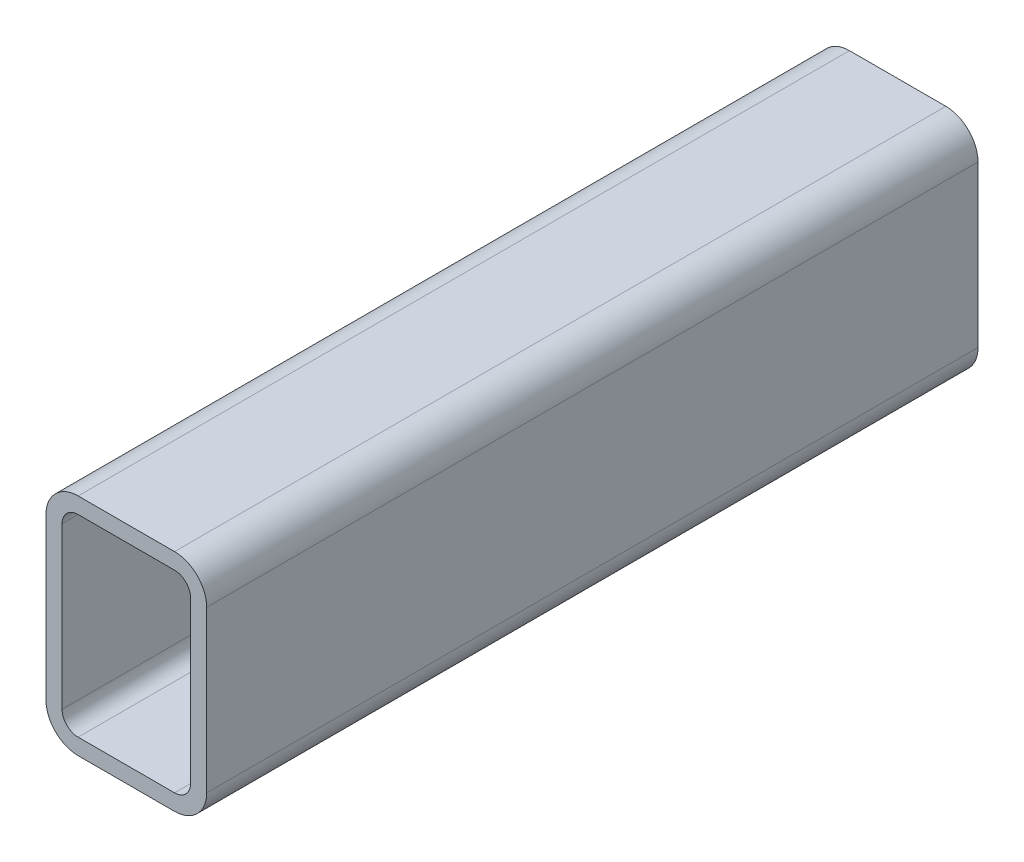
ISO-10303-21;
HEADER;
FILE_DESCRIPTION(('STEP AP214'),'2;1');
FILE_NAME('part.step','',(''),(''),'','','');
FILE_SCHEMA(('AUTOMOTIVE_DESIGN { 1 0 10303 214 1 1 1 1 }'));
ENDSEC;
DATA;
#1=APPLICATION_CONTEXT('core data for automotive mechanical design processes');
#2=APPLICATION_PROTOCOL_DEFINITION('international standard','automotive_design',2000,#1);
#3=PRODUCT_CONTEXT('',#1,'mechanical');
#4=PRODUCT('Part','Part','',(#3));
#5=PRODUCT_RELATED_PRODUCT_CATEGORY('part','',(#4));
#6=PRODUCT_DEFINITION_FORMATION('','',#4);
#7=PRODUCT_DEFINITION_CONTEXT('part definition',#1,'design');
#8=PRODUCT_DEFINITION('design','',#6,#7);
#9=PRODUCT_DEFINITION_SHAPE('','',#8);
#10=(LENGTH_UNIT() NAMED_UNIT(*) SI_UNIT(.MILLI.,.METRE.));
#11=(NAMED_UNIT(*) PLANE_ANGLE_UNIT() SI_UNIT($,.RADIAN.));
#12=(NAMED_UNIT(*) SI_UNIT($,.STERADIAN.) SOLID_ANGLE_UNIT());
#13=UNCERTAINTY_MEASURE_WITH_UNIT(LENGTH_MEASURE(1.E-05),#10,'distance_accuracy_value','');
#14=(GEOMETRIC_REPRESENTATION_CONTEXT(3) GLOBAL_UNCERTAINTY_ASSIGNED_CONTEXT((#13)) GLOBAL_UNIT_ASSIGNED_CONTEXT((#10,
#11,#12)) REPRESENTATION_CONTEXT('',''));
#15=CARTESIAN_POINT('',(0.,0.,0.));
#16=DIRECTION('',(0.,0.,1.));
#17=DIRECTION('',(1.,0.,0.));
#18=AXIS2_PLACEMENT_3D('',#15,#16,#17);
#19=CARTESIAN_POINT('',(15.5960851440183,77.0015103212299,304.8));
#20=DIRECTION('',(0.,0.,1.));
#21=DIRECTION('',(1.,0.,0.));
#22=AXIS2_PLACEMENT_3D('',#19,#20,#21);
#23=PLANE('',#22);
#24=CARTESIAN_POINT('',(15.5960851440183,77.0015103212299,304.8));
#25=DIRECTION('',(0.,0.,1.));
#26=DIRECTION('',(1.,0.,0.));
#27=AXIS2_PLACEMENT_3D('',#24,#25,#26);
#28=CIRCLE('',#27,12.7);
#29=CARTESIAN_POINT('',(15.5960851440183,89.7015103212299,304.8));
#30=VERTEX_POINT('',#29);
#31=CARTESIAN_POINT('',(2.89608514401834,77.0015103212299,304.8));
#32=VERTEX_POINT('',#31);
#33=EDGE_CURVE('E211',#30,#32,#28,.T.);
#34=ORIENTED_EDGE('',*,*,#33,.T.);
#35=DIRECTION('',(0.,-1.,0.));
#36=VECTOR('',#35,1.);
#37=CARTESIAN_POINT('',(2.89608514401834,13.5015103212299,304.8));
#38=LINE('',#37,#36);
#39=CARTESIAN_POINT('',(2.89608514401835,13.5015103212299,304.8));
#40=VERTEX_POINT('',#39);
#41=EDGE_CURVE('E214',#32,#40,#38,.T.);
#42=ORIENTED_EDGE('',*,*,#41,.T.);
#43=CARTESIAN_POINT('',(15.5960851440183,13.5015103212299,304.8));
#44=DIRECTION('',(0.,0.,1.));
#45=DIRECTION('',(1.,0.,0.));
#46=AXIS2_PLACEMENT_3D('',#43,#44,#45);
#47=CIRCLE('',#46,12.7);
#48=CARTESIAN_POINT('',(15.5960851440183,0.801510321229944,304.8));
#49=VERTEX_POINT('',#48);
#50=EDGE_CURVE('E217',#40,#49,#47,.T.);
#51=ORIENTED_EDGE('',*,*,#50,.T.);
#52=DIRECTION('',(1.,0.,0.));
#53=VECTOR('',#52,1.);
#54=CARTESIAN_POINT('',(53.6960851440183,0.801510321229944,304.8));
#55=LINE('',#54,#53);
#56=CARTESIAN_POINT('',(53.6960851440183,0.801510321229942,304.8));
#57=VERTEX_POINT('',#56);
#58=EDGE_CURVE('E219',#49,#57,#55,.T.);
#59=ORIENTED_EDGE('',*,*,#58,.T.);
#60=CARTESIAN_POINT('',(53.6960851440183,13.5015103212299,304.8));
#61=DIRECTION('',(0.,0.,1.));
#62=DIRECTION('',(1.,0.,0.));
#63=AXIS2_PLACEMENT_3D('',#60,#61,#62);
#64=CIRCLE('',#63,12.7);
#65=CARTESIAN_POINT('',(66.3960851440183,13.5015103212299,304.8));
#66=VERTEX_POINT('',#65);
#67=EDGE_CURVE('E221',#57,#66,#64,.T.);
#68=ORIENTED_EDGE('',*,*,#67,.T.);
#69=DIRECTION('',(0.,1.,0.));
#70=VECTOR('',#69,1.);
#71=CARTESIAN_POINT('',(66.3960851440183,77.0015103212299,304.8));
#72=LINE('',#71,#70);
#73=CARTESIAN_POINT('',(66.3960851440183,77.0015103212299,304.8));
#74=VERTEX_POINT('',#73);
#75=EDGE_CURVE('E223',#66,#74,#72,.T.);
#76=ORIENTED_EDGE('',*,*,#75,.T.);
#77=CARTESIAN_POINT('',(53.6960851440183,77.0015103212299,304.8));
#78=DIRECTION('',(0.,0.,1.));
#79=DIRECTION('',(1.,0.,0.));
#80=AXIS2_PLACEMENT_3D('',#77,#78,#79);
#81=CIRCLE('',#80,12.7);
#82=CARTESIAN_POINT('',(53.6960851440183,89.7015103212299,304.8));
#83=VERTEX_POINT('',#82);
#84=EDGE_CURVE('E225',#74,#83,#81,.T.);
#85=ORIENTED_EDGE('',*,*,#84,.T.);
#86=DIRECTION('',(-1.,0.,0.));
#87=VECTOR('',#86,1.);
#88=CARTESIAN_POINT('',(15.5960851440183,89.7015103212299,304.8));
#89=LINE('',#88,#87);
#90=EDGE_CURVE('E227',#83,#30,#89,.T.);
#91=ORIENTED_EDGE('',*,*,#90,.T.);
#92=EDGE_LOOP('',(#34,#42,#51,#59,#68,#76,#85,#91));
#93=FACE_BOUND('',#92,.T.);
#94=DIRECTION('',(0.,-1.,0.));
#95=VECTOR('',#94,1.);
#96=CARTESIAN_POINT('',(9.24608514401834,13.5015103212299,304.8));
#97=LINE('',#96,#95);
#98=CARTESIAN_POINT('',(9.24608514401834,77.0015103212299,304.8));
#99=VERTEX_POINT('',#98);
#100=CARTESIAN_POINT('',(9.24608514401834,13.5015103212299,304.8));
#101=VERTEX_POINT('',#100);
#102=EDGE_CURVE('E154',#99,#101,#97,.T.);
#103=ORIENTED_EDGE('',*,*,#102,.F.);
#104=CARTESIAN_POINT('',(15.5960851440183,77.0015103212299,304.8));
#105=DIRECTION('',(0.,0.,1.));
#106=DIRECTION('',(1.,0.,0.));
#107=AXIS2_PLACEMENT_3D('',#104,#105,#106);
#108=CIRCLE('',#107,6.35000000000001);
#109=CARTESIAN_POINT('',(15.5960851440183,83.3515103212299,304.8));
#110=VERTEX_POINT('',#109);
#111=EDGE_CURVE('E146',#110,#99,#108,.T.);
#112=ORIENTED_EDGE('',*,*,#111,.F.);
#113=DIRECTION('',(-1.,0.,0.));
#114=VECTOR('',#113,1.);
#115=CARTESIAN_POINT('',(15.5960851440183,83.3515103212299,304.8));
#116=LINE('',#115,#114);
#117=CARTESIAN_POINT('',(53.6960851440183,83.3515103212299,304.8));
#118=VERTEX_POINT('',#117);
#119=EDGE_CURVE('E179',#118,#110,#116,.T.);
#120=ORIENTED_EDGE('',*,*,#119,.F.);
#121=CARTESIAN_POINT('',(53.6960851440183,77.0015103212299,304.8));
#122=DIRECTION('',(0.,0.,1.));
#123=DIRECTION('',(1.,0.,0.));
#124=AXIS2_PLACEMENT_3D('',#121,#122,#123);
#125=CIRCLE('',#124,6.35000000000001);
#126=CARTESIAN_POINT('',(60.0460851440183,77.0015103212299,304.8));
#127=VERTEX_POINT('',#126);
#128=EDGE_CURVE('E177',#127,#118,#125,.T.);
#129=ORIENTED_EDGE('',*,*,#128,.F.);
#130=DIRECTION('',(0.,1.,0.));
#131=VECTOR('',#130,1.);
#132=CARTESIAN_POINT('',(60.0460851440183,77.0015103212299,304.8));
#133=LINE('',#132,#131);
#134=CARTESIAN_POINT('',(60.0460851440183,13.5015103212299,304.8));
#135=VERTEX_POINT('',#134);
#136=EDGE_CURVE('E175',#135,#127,#133,.T.);
#137=ORIENTED_EDGE('',*,*,#136,.F.);
#138=CARTESIAN_POINT('',(53.6960851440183,13.5015103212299,304.8));
#139=DIRECTION('',(0.,0.,1.));
#140=DIRECTION('',(1.,0.,0.));
#141=AXIS2_PLACEMENT_3D('',#138,#139,#140);
#142=CIRCLE('',#141,6.35000000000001);
#143=CARTESIAN_POINT('',(53.6960851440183,7.15151032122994,304.8));
#144=VERTEX_POINT('',#143);
#145=EDGE_CURVE('E173',#144,#135,#142,.T.);
#146=ORIENTED_EDGE('',*,*,#145,.F.);
#147=DIRECTION('',(1.,0.,0.));
#148=VECTOR('',#147,1.);
#149=CARTESIAN_POINT('',(53.6960851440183,7.15151032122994,304.8));
#150=LINE('',#149,#148);
#151=CARTESIAN_POINT('',(15.5960851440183,7.15151032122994,304.8));
#152=VERTEX_POINT('',#151);
#153=EDGE_CURVE('E169',#152,#144,#150,.T.);
#154=ORIENTED_EDGE('',*,*,#153,.F.);
#155=CARTESIAN_POINT('',(15.5960851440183,13.5015103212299,304.8));
#156=DIRECTION('',(0.,0.,1.));
#157=DIRECTION('',(1.,0.,0.));
#158=AXIS2_PLACEMENT_3D('',#155,#156,#157);
#159=CIRCLE('',#158,6.35);
#160=EDGE_CURVE('E167',#101,#152,#159,.T.);
#161=ORIENTED_EDGE('',*,*,#160,.F.);
#162=EDGE_LOOP('',(#103,#112,#120,#129,#137,#146,#154,#161));
#163=FACE_BOUND('',#162,.T.);
#164=ADVANCED_FACE('F33',(#93,#163),#23,.T.);
#165=CARTESIAN_POINT('',(15.5960851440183,77.0015103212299,0.));
#166=DIRECTION('',(0.,0.,1.));
#167=DIRECTION('',(1.,0.,0.));
#168=AXIS2_PLACEMENT_3D('',#165,#166,#167);
#169=PLANE('',#168);
#170=CARTESIAN_POINT('',(15.5960851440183,77.0015103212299,0.));
#171=DIRECTION('',(0.,0.,1.));
#172=DIRECTION('',(1.,0.,0.));
#173=AXIS2_PLACEMENT_3D('',#170,#171,#172);
#174=CIRCLE('',#173,12.7);
#175=CARTESIAN_POINT('',(15.5960851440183,89.7015103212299,0.));
#176=VERTEX_POINT('',#175);
#177=CARTESIAN_POINT('',(2.89608514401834,77.0015103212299,0.));
#178=VERTEX_POINT('',#177);
#179=EDGE_CURVE('E162',#176,#178,#174,.T.);
#180=ORIENTED_EDGE('',*,*,#179,.F.);
#181=DIRECTION('',(-1.,0.,0.));
#182=VECTOR('',#181,1.);
#183=CARTESIAN_POINT('',(15.5960851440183,89.7015103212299,0.));
#184=LINE('',#183,#182);
#185=CARTESIAN_POINT('',(53.6960851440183,89.7015103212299,0.));
#186=VERTEX_POINT('',#185);
#187=EDGE_CURVE('E215',#186,#176,#184,.T.);
#188=ORIENTED_EDGE('',*,*,#187,.F.);
#189=CARTESIAN_POINT('',(53.6960851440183,77.0015103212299,0.));
#190=DIRECTION('',(0.,0.,1.));
#191=DIRECTION('',(1.,0.,0.));
#192=AXIS2_PLACEMENT_3D('',#189,#190,#191);
#193=CIRCLE('',#192,12.7);
#194=CARTESIAN_POINT('',(66.3960851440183,77.0015103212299,0.));
#195=VERTEX_POINT('',#194);
#196=EDGE_CURVE('E242',#195,#186,#193,.T.);
#197=ORIENTED_EDGE('',*,*,#196,.F.);
#198=DIRECTION('',(0.,1.,0.));
#199=VECTOR('',#198,1.);
#200=CARTESIAN_POINT('',(66.3960851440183,77.0015103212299,0.));
#201=LINE('',#200,#199);
#202=CARTESIAN_POINT('',(66.3960851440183,13.5015103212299,0.));
#203=VERTEX_POINT('',#202);
#204=EDGE_CURVE('E240',#203,#195,#201,.T.);
#205=ORIENTED_EDGE('',*,*,#204,.F.);
#206=CARTESIAN_POINT('',(53.6960851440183,13.5015103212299,0.));
#207=DIRECTION('',(0.,0.,1.));
#208=DIRECTION('',(1.,0.,0.));
#209=AXIS2_PLACEMENT_3D('',#206,#207,#208);
#210=CIRCLE('',#209,12.7);
#211=CARTESIAN_POINT('',(53.6960851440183,0.801510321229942,0.));
#212=VERTEX_POINT('',#211);
#213=EDGE_CURVE('E238',#212,#203,#210,.T.);
#214=ORIENTED_EDGE('',*,*,#213,.F.);
#215=DIRECTION('',(1.,0.,0.));
#216=VECTOR('',#215,1.);
#217=CARTESIAN_POINT('',(53.6960851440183,0.801510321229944,0.));
#218=LINE('',#217,#216);
#219=CARTESIAN_POINT('',(15.5960851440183,0.801510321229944,0.));
#220=VERTEX_POINT('',#219);
#221=EDGE_CURVE('E236',#220,#212,#218,.T.);
#222=ORIENTED_EDGE('',*,*,#221,.F.);
#223=CARTESIAN_POINT('',(15.5960851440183,13.5015103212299,0.));
#224=DIRECTION('',(0.,0.,1.));
#225=DIRECTION('',(1.,0.,0.));
#226=AXIS2_PLACEMENT_3D('',#223,#224,#225);
#227=CIRCLE('',#226,12.7);
#228=CARTESIAN_POINT('',(2.89608514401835,13.5015103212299,0.));
#229=VERTEX_POINT('',#228);
#230=EDGE_CURVE('E234',#229,#220,#227,.T.);
#231=ORIENTED_EDGE('',*,*,#230,.F.);
#232=DIRECTION('',(0.,-1.,0.));
#233=VECTOR('',#232,1.);
#234=CARTESIAN_POINT('',(2.89608514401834,13.5015103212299,0.));
#235=LINE('',#234,#233);
#236=EDGE_CURVE('E232',#178,#229,#235,.T.);
#237=ORIENTED_EDGE('',*,*,#236,.F.);
#238=EDGE_LOOP('',(#180,#188,#197,#205,#214,#222,#231,#237));
#239=FACE_BOUND('',#238,.T.);
#240=CARTESIAN_POINT('',(15.5960851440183,77.0015103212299,0.));
#241=DIRECTION('',(0.,0.,1.));
#242=DIRECTION('',(1.,0.,0.));
#243=AXIS2_PLACEMENT_3D('',#240,#241,#242);
#244=CIRCLE('',#243,6.35000000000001);
#245=CARTESIAN_POINT('',(15.5960851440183,83.3515103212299,0.));
#246=VERTEX_POINT('',#245);
#247=CARTESIAN_POINT('',(9.24608514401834,77.0015103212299,0.));
#248=VERTEX_POINT('',#247);
#249=EDGE_CURVE('E56',#246,#248,#244,.T.);
#250=ORIENTED_EDGE('',*,*,#249,.T.);
#251=DIRECTION('',(0.,-1.,0.));
#252=VECTOR('',#251,1.);
#253=CARTESIAN_POINT('',(9.24608514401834,13.5015103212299,0.));
#254=LINE('',#253,#252);
#255=CARTESIAN_POINT('',(9.24608514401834,13.5015103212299,0.));
#256=VERTEX_POINT('',#255);
#257=EDGE_CURVE('E161',#248,#256,#254,.T.);
#258=ORIENTED_EDGE('',*,*,#257,.T.);
#259=CARTESIAN_POINT('',(15.5960851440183,13.5015103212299,0.));
#260=DIRECTION('',(0.,0.,1.));
#261=DIRECTION('',(1.,0.,0.));
#262=AXIS2_PLACEMENT_3D('',#259,#260,#261);
#263=CIRCLE('',#262,6.35);
#264=CARTESIAN_POINT('',(15.5960851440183,7.15151032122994,0.));
#265=VERTEX_POINT('',#264);
#266=EDGE_CURVE('E183',#256,#265,#263,.T.);
#267=ORIENTED_EDGE('',*,*,#266,.T.);
#268=DIRECTION('',(1.,0.,0.));
#269=VECTOR('',#268,1.);
#270=CARTESIAN_POINT('',(53.6960851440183,7.15151032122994,0.));
#271=LINE('',#270,#269);
#272=CARTESIAN_POINT('',(53.6960851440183,7.15151032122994,0.));
#273=VERTEX_POINT('',#272);
#274=EDGE_CURVE('E186',#265,#273,#271,.T.);
#275=ORIENTED_EDGE('',*,*,#274,.T.);
#276=CARTESIAN_POINT('',(53.6960851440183,13.5015103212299,0.));
#277=DIRECTION('',(0.,0.,1.));
#278=DIRECTION('',(1.,0.,0.));
#279=AXIS2_PLACEMENT_3D('',#276,#277,#278);
#280=CIRCLE('',#279,6.35000000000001);
#281=CARTESIAN_POINT('',(60.0460851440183,13.5015103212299,0.));
#282=VERTEX_POINT('',#281);
#283=EDGE_CURVE('E189',#273,#282,#280,.T.);
#284=ORIENTED_EDGE('',*,*,#283,.T.);
#285=DIRECTION('',(0.,1.,0.));
#286=VECTOR('',#285,1.);
#287=CARTESIAN_POINT('',(60.0460851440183,77.0015103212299,0.));
#288=LINE('',#287,#286);
#289=CARTESIAN_POINT('',(60.0460851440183,77.0015103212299,0.));
#290=VERTEX_POINT('',#289);
#291=EDGE_CURVE('E192',#282,#290,#288,.T.);
#292=ORIENTED_EDGE('',*,*,#291,.T.);
#293=CARTESIAN_POINT('',(53.6960851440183,77.0015103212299,0.));
#294=DIRECTION('',(0.,0.,1.));
#295=DIRECTION('',(1.,0.,0.));
#296=AXIS2_PLACEMENT_3D('',#293,#294,#295);
#297=CIRCLE('',#296,6.35000000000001);
#298=CARTESIAN_POINT('',(53.6960851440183,83.3515103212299,0.));
#299=VERTEX_POINT('',#298);
#300=EDGE_CURVE('E195',#290,#299,#297,.T.);
#301=ORIENTED_EDGE('',*,*,#300,.T.);
#302=DIRECTION('',(-1.,0.,0.));
#303=VECTOR('',#302,1.);
#304=CARTESIAN_POINT('',(15.5960851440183,83.3515103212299,0.));
#305=LINE('',#304,#303);
#306=EDGE_CURVE('E155',#299,#246,#305,.T.);
#307=ORIENTED_EDGE('',*,*,#306,.T.);
#308=EDGE_LOOP('',(#250,#258,#267,#275,#284,#292,#301,#307));
#309=FACE_BOUND('',#308,.T.);
#310=ADVANCED_FACE('F272',(#239,#309),#169,.F.);
#311=CARTESIAN_POINT('',(15.5960851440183,77.0015103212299,304.8));
#312=DIRECTION('',(0.,0.,-1.));
#313=DIRECTION('',(-1.,0.,0.));
#314=AXIS2_PLACEMENT_3D('',#311,#312,#313);
#315=CYLINDRICAL_SURFACE('',#314,12.7);
#316=ORIENTED_EDGE('',*,*,#179,.T.);
#317=DIRECTION('',(0.,0.,-1.));
#318=VECTOR('',#317,1.);
#319=CARTESIAN_POINT('',(2.89608514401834,77.0015103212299,304.8));
#320=LINE('',#319,#318);
#321=EDGE_CURVE('E11',#32,#178,#320,.T.);
#322=ORIENTED_EDGE('',*,*,#321,.F.);
#323=ORIENTED_EDGE('',*,*,#33,.F.);
#324=DIRECTION('',(0.,0.,-1.));
#325=VECTOR('',#324,1.);
#326=CARTESIAN_POINT('',(15.5960851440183,89.7015103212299,304.8));
#327=LINE('',#326,#325);
#328=EDGE_CURVE('E229',#30,#176,#327,.T.);
#329=ORIENTED_EDGE('',*,*,#328,.T.);
#330=EDGE_LOOP('',(#316,#322,#323,#329));
#331=FACE_BOUND('',#330,.T.);
#332=ADVANCED_FACE('F35',(#331),#315,.T.);
#333=CARTESIAN_POINT('',(2.89608514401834,13.5015103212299,304.8));
#334=DIRECTION('',(1.,0.,0.));
#335=DIRECTION('',(0.,0.,-1.));
#336=AXIS2_PLACEMENT_3D('',#333,#334,#335);
#337=PLANE('',#336);
#338=ORIENTED_EDGE('',*,*,#236,.T.);
#339=DIRECTION('',(0.,0.,-1.));
#340=VECTOR('',#339,1.);
#341=CARTESIAN_POINT('',(2.89608514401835,13.5015103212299,304.8));
#342=LINE('',#341,#340);
#343=EDGE_CURVE('E41',#40,#229,#342,.T.);
#344=ORIENTED_EDGE('',*,*,#343,.F.);
#345=ORIENTED_EDGE('',*,*,#41,.F.);
#346=ORIENTED_EDGE('',*,*,#321,.T.);
#347=EDGE_LOOP('',(#338,#344,#345,#346));
#348=FACE_BOUND('',#347,.T.);
#349=ADVANCED_FACE('F289',(#348),#337,.F.);
#350=CARTESIAN_POINT('',(15.5960851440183,13.5015103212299,304.8));
#351=DIRECTION('',(0.,0.,-1.));
#352=DIRECTION('',(-1.,0.,0.));
#353=AXIS2_PLACEMENT_3D('',#350,#351,#352);
#354=CYLINDRICAL_SURFACE('',#353,12.7);
#355=ORIENTED_EDGE('',*,*,#230,.T.);
#356=DIRECTION('',(0.,0.,-1.));
#357=VECTOR('',#356,1.);
#358=CARTESIAN_POINT('',(15.5960851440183,0.801510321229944,304.8));
#359=LINE('',#358,#357);
#360=EDGE_CURVE('E259',#49,#220,#359,.T.);
#361=ORIENTED_EDGE('',*,*,#360,.F.);
#362=ORIENTED_EDGE('',*,*,#50,.F.);
#363=ORIENTED_EDGE('',*,*,#343,.T.);
#364=EDGE_LOOP('',(#355,#361,#362,#363));
#365=FACE_BOUND('',#364,.T.);
#366=ADVANCED_FACE('F266',(#365),#354,.T.);
#367=CARTESIAN_POINT('',(53.6960851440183,0.801510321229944,304.8));
#368=DIRECTION('',(0.,1.,0.));
#369=DIRECTION('',(0.,0.,1.));
#370=AXIS2_PLACEMENT_3D('',#367,#368,#369);
#371=PLANE('',#370);
#372=ORIENTED_EDGE('',*,*,#221,.T.);
#373=DIRECTION('',(0.,0.,-1.));
#374=VECTOR('',#373,1.);
#375=CARTESIAN_POINT('',(53.6960851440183,0.801510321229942,304.8));
#376=LINE('',#375,#374);
#377=EDGE_CURVE('E256',#57,#212,#376,.T.);
#378=ORIENTED_EDGE('',*,*,#377,.F.);
#379=ORIENTED_EDGE('',*,*,#58,.F.);
#380=ORIENTED_EDGE('',*,*,#360,.T.);
#381=EDGE_LOOP('',(#372,#378,#379,#380));
#382=FACE_BOUND('',#381,.T.);
#383=ADVANCED_FACE('F278',(#382),#371,.F.);
#384=CARTESIAN_POINT('',(53.6960851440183,13.5015103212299,304.8));
#385=DIRECTION('',(0.,0.,-1.));
#386=DIRECTION('',(-1.,0.,0.));
#387=AXIS2_PLACEMENT_3D('',#384,#385,#386);
#388=CYLINDRICAL_SURFACE('',#387,12.7);
#389=ORIENTED_EDGE('',*,*,#213,.T.);
#390=DIRECTION('',(0.,0.,-1.));
#391=VECTOR('',#390,1.);
#392=CARTESIAN_POINT('',(66.3960851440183,13.5015103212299,304.8));
#393=LINE('',#392,#391);
#394=EDGE_CURVE('E253',#66,#203,#393,.T.);
#395=ORIENTED_EDGE('',*,*,#394,.F.);
#396=ORIENTED_EDGE('',*,*,#67,.F.);
#397=ORIENTED_EDGE('',*,*,#377,.T.);
#398=EDGE_LOOP('',(#389,#395,#396,#397));
#399=FACE_BOUND('',#398,.T.);
#400=ADVANCED_FACE('F282',(#399),#388,.T.);
#401=CARTESIAN_POINT('',(66.3960851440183,77.0015103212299,304.8));
#402=DIRECTION('',(-1.,0.,0.));
#403=DIRECTION('',(0.,0.,1.));
#404=AXIS2_PLACEMENT_3D('',#401,#402,#403);
#405=PLANE('',#404);
#406=ORIENTED_EDGE('',*,*,#204,.T.);
#407=DIRECTION('',(0.,0.,-1.));
#408=VECTOR('',#407,1.);
#409=CARTESIAN_POINT('',(66.3960851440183,77.0015103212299,304.8));
#410=LINE('',#409,#408);
#411=EDGE_CURVE('E250',#74,#195,#410,.T.);
#412=ORIENTED_EDGE('',*,*,#411,.F.);
#413=ORIENTED_EDGE('',*,*,#75,.F.);
#414=ORIENTED_EDGE('',*,*,#394,.T.);
#415=EDGE_LOOP('',(#406,#412,#413,#414));
#416=FACE_BOUND('',#415,.T.);
#417=ADVANCED_FACE('F302',(#416),#405,.F.);
#418=CARTESIAN_POINT('',(53.6960851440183,77.0015103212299,304.8));
#419=DIRECTION('',(0.,0.,-1.));
#420=DIRECTION('',(-1.,0.,0.));
#421=AXIS2_PLACEMENT_3D('',#418,#419,#420);
#422=CYLINDRICAL_SURFACE('',#421,12.7);
#423=ORIENTED_EDGE('',*,*,#196,.T.);
#424=DIRECTION('',(0.,0.,-1.));
#425=VECTOR('',#424,1.);
#426=CARTESIAN_POINT('',(53.6960851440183,89.7015103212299,304.8));
#427=LINE('',#426,#425);
#428=EDGE_CURVE('E247',#83,#186,#427,.T.);
#429=ORIENTED_EDGE('',*,*,#428,.F.);
#430=ORIENTED_EDGE('',*,*,#84,.F.);
#431=ORIENTED_EDGE('',*,*,#411,.T.);
#432=EDGE_LOOP('',(#423,#429,#430,#431));
#433=FACE_BOUND('',#432,.T.);
#434=ADVANCED_FACE('F300',(#433),#422,.T.);
#435=CARTESIAN_POINT('',(15.5960851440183,89.7015103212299,304.8));
#436=DIRECTION('',(0.,-1.,0.));
#437=DIRECTION('',(0.,0.,-1.));
#438=AXIS2_PLACEMENT_3D('',#435,#436,#437);
#439=PLANE('',#438);
#440=ORIENTED_EDGE('',*,*,#187,.T.);
#441=ORIENTED_EDGE('',*,*,#328,.F.);
#442=ORIENTED_EDGE('',*,*,#90,.F.);
#443=ORIENTED_EDGE('',*,*,#428,.T.);
#444=EDGE_LOOP('',(#440,#441,#442,#443));
#445=FACE_BOUND('',#444,.T.);
#446=ADVANCED_FACE('F295',(#445),#439,.F.);
#447=CARTESIAN_POINT('',(15.5960851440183,77.0015103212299,304.8));
#448=DIRECTION('',(0.,0.,-1.));
#449=DIRECTION('',(-1.,0.,0.));
#450=AXIS2_PLACEMENT_3D('',#447,#448,#449);
#451=CYLINDRICAL_SURFACE('',#450,6.35000000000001);
#452=ORIENTED_EDGE('',*,*,#249,.F.);
#453=DIRECTION('',(0.,0.,-1.));
#454=VECTOR('',#453,1.);
#455=CARTESIAN_POINT('',(15.5960851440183,83.3515103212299,304.8));
#456=LINE('',#455,#454);
#457=EDGE_CURVE('E150',#110,#246,#456,.T.);
#458=ORIENTED_EDGE('',*,*,#457,.F.);
#459=ORIENTED_EDGE('',*,*,#111,.T.);
#460=DIRECTION('',(0.,0.,-1.));
#461=VECTOR('',#460,1.);
#462=CARTESIAN_POINT('',(9.24608514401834,77.0015103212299,304.8));
#463=LINE('',#462,#461);
#464=EDGE_CURVE('E149',#99,#248,#463,.T.);
#465=ORIENTED_EDGE('',*,*,#464,.T.);
#466=EDGE_LOOP('',(#452,#458,#459,#465));
#467=FACE_BOUND('',#466,.T.);
#468=ADVANCED_FACE('F148',(#467),#451,.F.);
#469=CARTESIAN_POINT('',(9.24608514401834,13.5015103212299,304.8));
#470=DIRECTION('',(1.,0.,0.));
#471=DIRECTION('',(0.,0.,-1.));
#472=AXIS2_PLACEMENT_3D('',#469,#470,#471);
#473=PLANE('',#472);
#474=ORIENTED_EDGE('',*,*,#257,.F.);
#475=ORIENTED_EDGE('',*,*,#464,.F.);
#476=ORIENTED_EDGE('',*,*,#102,.T.);
#477=DIRECTION('',(0.,0.,-1.));
#478=VECTOR('',#477,1.);
#479=CARTESIAN_POINT('',(9.24608514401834,13.5015103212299,304.8));
#480=LINE('',#479,#478);
#481=EDGE_CURVE('E163',#101,#256,#480,.T.);
#482=ORIENTED_EDGE('',*,*,#481,.T.);
#483=EDGE_LOOP('',(#474,#475,#476,#482));
#484=FACE_BOUND('',#483,.T.);
#485=ADVANCED_FACE('F158',(#484),#473,.T.);
#486=CARTESIAN_POINT('',(15.5960851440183,13.5015103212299,304.8));
#487=DIRECTION('',(0.,0.,-1.));
#488=DIRECTION('',(-1.,0.,0.));
#489=AXIS2_PLACEMENT_3D('',#486,#487,#488);
#490=CYLINDRICAL_SURFACE('',#489,6.35);
#491=ORIENTED_EDGE('',*,*,#266,.F.);
#492=ORIENTED_EDGE('',*,*,#481,.F.);
#493=ORIENTED_EDGE('',*,*,#160,.T.);
#494=DIRECTION('',(0.,0.,-1.));
#495=VECTOR('',#494,1.);
#496=CARTESIAN_POINT('',(15.5960851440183,7.15151032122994,304.8));
#497=LINE('',#496,#495);
#498=EDGE_CURVE('E208',#152,#265,#497,.T.);
#499=ORIENTED_EDGE('',*,*,#498,.T.);
#500=EDGE_LOOP('',(#491,#492,#493,#499));
#501=FACE_BOUND('',#500,.T.);
#502=ADVANCED_FACE('F327',(#501),#490,.F.);
#503=CARTESIAN_POINT('',(53.6960851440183,7.15151032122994,304.8));
#504=DIRECTION('',(0.,1.,0.));
#505=DIRECTION('',(0.,0.,1.));
#506=AXIS2_PLACEMENT_3D('',#503,#504,#505);
#507=PLANE('',#506);
#508=ORIENTED_EDGE('',*,*,#274,.F.);
#509=ORIENTED_EDGE('',*,*,#498,.F.);
#510=ORIENTED_EDGE('',*,*,#153,.T.);
#511=DIRECTION('',(0.,0.,-1.));
#512=VECTOR('',#511,1.);
#513=CARTESIAN_POINT('',(53.6960851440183,7.15151032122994,304.8));
#514=LINE('',#513,#512);
#515=EDGE_CURVE('E206',#144,#273,#514,.T.);
#516=ORIENTED_EDGE('',*,*,#515,.T.);
#517=EDGE_LOOP('',(#508,#509,#510,#516));
#518=FACE_BOUND('',#517,.T.);
#519=ADVANCED_FACE('F331',(#518),#507,.T.);
#520=CARTESIAN_POINT('',(53.6960851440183,13.5015103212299,304.8));
#521=DIRECTION('',(0.,0.,-1.));
#522=DIRECTION('',(-1.,0.,0.));
#523=AXIS2_PLACEMENT_3D('',#520,#521,#522);
#524=CYLINDRICAL_SURFACE('',#523,6.35000000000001);
#525=ORIENTED_EDGE('',*,*,#283,.F.);
#526=ORIENTED_EDGE('',*,*,#515,.F.);
#527=ORIENTED_EDGE('',*,*,#145,.T.);
#528=DIRECTION('',(0.,0.,-1.));
#529=VECTOR('',#528,1.);
#530=CARTESIAN_POINT('',(60.0460851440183,13.5015103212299,304.8));
#531=LINE('',#530,#529);
#532=EDGE_CURVE('E204',#135,#282,#531,.T.);
#533=ORIENTED_EDGE('',*,*,#532,.T.);
#534=EDGE_LOOP('',(#525,#526,#527,#533));
#535=FACE_BOUND('',#534,.T.);
#536=ADVANCED_FACE('F337',(#535),#524,.F.);
#537=CARTESIAN_POINT('',(60.0460851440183,77.0015103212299,304.8));
#538=DIRECTION('',(-1.,0.,0.));
#539=DIRECTION('',(0.,0.,1.));
#540=AXIS2_PLACEMENT_3D('',#537,#538,#539);
#541=PLANE('',#540);
#542=ORIENTED_EDGE('',*,*,#291,.F.);
#543=ORIENTED_EDGE('',*,*,#532,.F.);
#544=ORIENTED_EDGE('',*,*,#136,.T.);
#545=DIRECTION('',(0.,0.,-1.));
#546=VECTOR('',#545,1.);
#547=CARTESIAN_POINT('',(60.0460851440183,77.0015103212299,304.8));
#548=LINE('',#547,#546);
#549=EDGE_CURVE('E202',#127,#290,#548,.T.);
#550=ORIENTED_EDGE('',*,*,#549,.T.);
#551=EDGE_LOOP('',(#542,#543,#544,#550));
#552=FACE_BOUND('',#551,.T.);
#553=ADVANCED_FACE('F341',(#552),#541,.T.);
#554=CARTESIAN_POINT('',(53.6960851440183,77.0015103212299,304.8));
#555=DIRECTION('',(0.,0.,-1.));
#556=DIRECTION('',(-1.,0.,0.));
#557=AXIS2_PLACEMENT_3D('',#554,#555,#556);
#558=CYLINDRICAL_SURFACE('',#557,6.35000000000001);
#559=ORIENTED_EDGE('',*,*,#300,.F.);
#560=ORIENTED_EDGE('',*,*,#549,.F.);
#561=ORIENTED_EDGE('',*,*,#128,.T.);
#562=DIRECTION('',(0.,0.,-1.));
#563=VECTOR('',#562,1.);
#564=CARTESIAN_POINT('',(53.6960851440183,83.3515103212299,304.8));
#565=LINE('',#564,#563);
#566=EDGE_CURVE('E48',#118,#299,#565,.T.);
#567=ORIENTED_EDGE('',*,*,#566,.T.);
#568=EDGE_LOOP('',(#559,#560,#561,#567));
#569=FACE_BOUND('',#568,.T.);
#570=ADVANCED_FACE('F345',(#569),#558,.F.);
#571=CARTESIAN_POINT('',(15.5960851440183,83.3515103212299,304.8));
#572=DIRECTION('',(0.,-1.,0.));
#573=DIRECTION('',(0.,0.,-1.));
#574=AXIS2_PLACEMENT_3D('',#571,#572,#573);
#575=PLANE('',#574);
#576=ORIENTED_EDGE('',*,*,#306,.F.);
#577=ORIENTED_EDGE('',*,*,#566,.F.);
#578=ORIENTED_EDGE('',*,*,#119,.T.);
#579=ORIENTED_EDGE('',*,*,#457,.T.);
#580=EDGE_LOOP('',(#576,#577,#578,#579));
#581=FACE_BOUND('',#580,.T.);
#582=ADVANCED_FACE('F349',(#581),#575,.T.);
#583=CLOSED_SHELL('',(#164,#310,#332,#349,#366,#383,#400,#417,#434,#446,#468,#485,#502,#519,
#536,#553,#570,#582));
#584=MANIFOLD_SOLID_BREP('B2',#583);
#585=ADVANCED_BREP_SHAPE_REPRESENTATION('',(#18,#584),#14);
#586=SHAPE_DEFINITION_REPRESENTATION(#9,#585);
ENDSEC;
END-ISO-10303-21;
